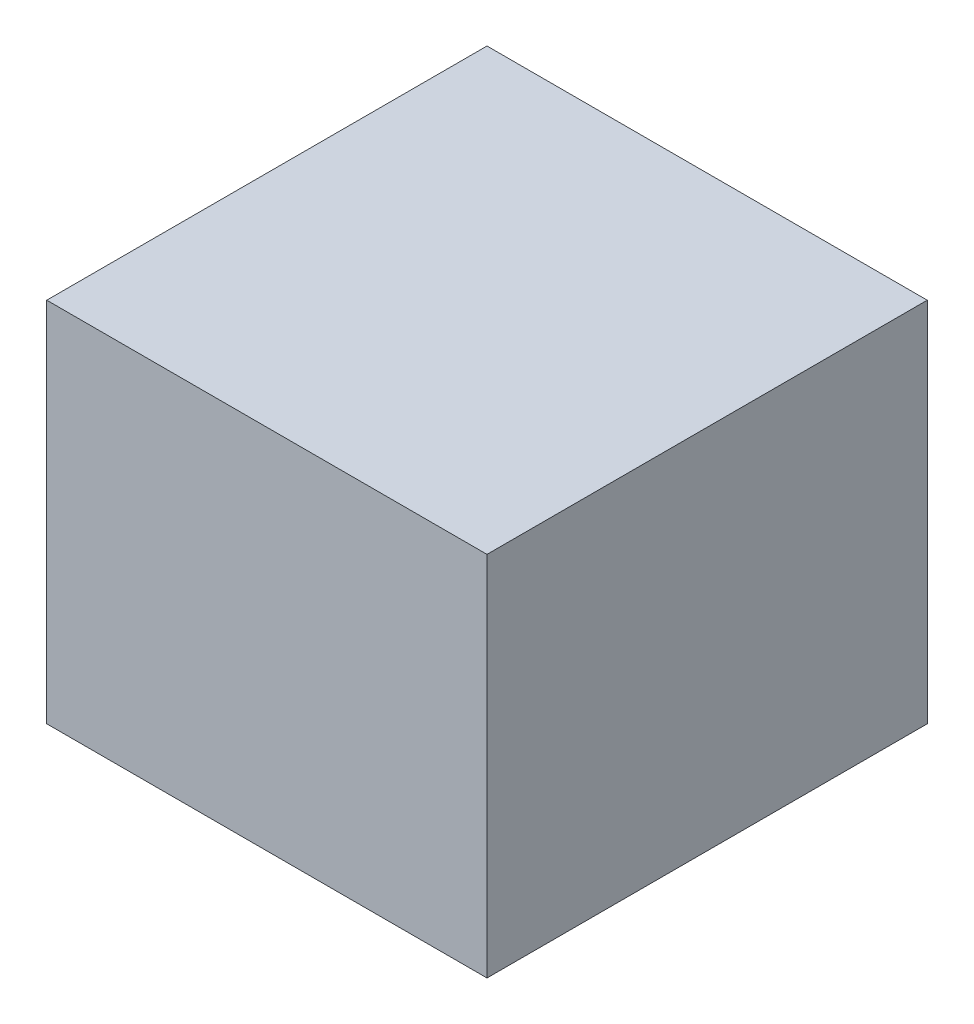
ISO-10303-21;
HEADER;
FILE_DESCRIPTION(('STEP AP214'),'2;1');
FILE_NAME('part.step','',(''),(''),'','','');
FILE_SCHEMA(('AUTOMOTIVE_DESIGN { 1 0 10303 214 1 1 1 1 }'));
ENDSEC;
DATA;
#1=APPLICATION_CONTEXT('core data for automotive mechanical design processes');
#2=APPLICATION_PROTOCOL_DEFINITION('international standard','automotive_design',2000,#1);
#3=PRODUCT_CONTEXT('',#1,'mechanical');
#4=PRODUCT('Part','Part','',(#3));
#5=PRODUCT_RELATED_PRODUCT_CATEGORY('part','',(#4));
#6=PRODUCT_DEFINITION_FORMATION('','',#4);
#7=PRODUCT_DEFINITION_CONTEXT('part definition',#1,'design');
#8=PRODUCT_DEFINITION('design','',#6,#7);
#9=PRODUCT_DEFINITION_SHAPE('','',#8);
#10=(LENGTH_UNIT() NAMED_UNIT(*) SI_UNIT(.MILLI.,.METRE.));
#11=(NAMED_UNIT(*) PLANE_ANGLE_UNIT() SI_UNIT($,.RADIAN.));
#12=(NAMED_UNIT(*) SI_UNIT($,.STERADIAN.) SOLID_ANGLE_UNIT());
#13=UNCERTAINTY_MEASURE_WITH_UNIT(LENGTH_MEASURE(1.E-05),#10,'distance_accuracy_value','');
#14=(GEOMETRIC_REPRESENTATION_CONTEXT(3) GLOBAL_UNCERTAINTY_ASSIGNED_CONTEXT((#13)) GLOBAL_UNIT_ASSIGNED_CONTEXT((#10,
#11,#12)) REPRESENTATION_CONTEXT('',''));
#15=CARTESIAN_POINT('',(0.,0.,0.));
#16=DIRECTION('',(0.,0.,1.));
#17=DIRECTION('',(1.,0.,0.));
#18=AXIS2_PLACEMENT_3D('',#15,#16,#17);
#19=CARTESIAN_POINT('',(30.,50.,30.));
#20=DIRECTION('',(-1.,0.,0.));
#21=DIRECTION('',(0.,0.,1.));
#22=AXIS2_PLACEMENT_3D('',#19,#20,#21);
#23=PLANE('',#22);
#24=DIRECTION('',(0.,0.,-1.));
#25=VECTOR('',#24,1.);
#26=CARTESIAN_POINT('',(30.,0.,30.));
#27=LINE('',#26,#25);
#28=CARTESIAN_POINT('',(30.,0.,30.));
#29=VERTEX_POINT('',#28);
#30=CARTESIAN_POINT('',(30.,0.,-30.));
#31=VERTEX_POINT('',#30);
#32=EDGE_CURVE('E70',#29,#31,#27,.T.);
#33=ORIENTED_EDGE('',*,*,#32,.T.);
#34=DIRECTION('',(0.,-1.,0.));
#35=VECTOR('',#34,1.);
#36=CARTESIAN_POINT('',(30.,50.,-30.));
#37=LINE('',#36,#35);
#38=CARTESIAN_POINT('',(30.,50.,-30.));
#39=VERTEX_POINT('',#38);
#40=EDGE_CURVE('E11',#39,#31,#37,.T.);
#41=ORIENTED_EDGE('',*,*,#40,.F.);
#42=DIRECTION('',(0.,0.,-1.));
#43=VECTOR('',#42,1.);
#44=CARTESIAN_POINT('',(30.,50.,30.));
#45=LINE('',#44,#43);
#46=CARTESIAN_POINT('',(30.,50.,30.));
#47=VERTEX_POINT('',#46);
#48=EDGE_CURVE('E88',#47,#39,#45,.T.);
#49=ORIENTED_EDGE('',*,*,#48,.F.);
#50=DIRECTION('',(0.,-1.,0.));
#51=VECTOR('',#50,1.);
#52=CARTESIAN_POINT('',(30.,50.,30.));
#53=LINE('',#52,#51);
#54=EDGE_CURVE('E82',#47,#29,#53,.T.);
#55=ORIENTED_EDGE('',*,*,#54,.T.);
#56=EDGE_LOOP('',(#33,#41,#49,#55));
#57=FACE_BOUND('',#56,.T.);
#58=ADVANCED_FACE('F26',(#57),#23,.F.);
#59=CARTESIAN_POINT('',(30.,50.,-30.));
#60=DIRECTION('',(0.,0.,1.));
#61=DIRECTION('',(1.,0.,0.));
#62=AXIS2_PLACEMENT_3D('',#59,#60,#61);
#63=PLANE('',#62);
#64=DIRECTION('',(-1.,0.,0.));
#65=VECTOR('',#64,1.);
#66=CARTESIAN_POINT('',(30.,0.,-30.));
#67=LINE('',#66,#65);
#68=CARTESIAN_POINT('',(-30.,0.,-30.));
#69=VERTEX_POINT('',#68);
#70=EDGE_CURVE('E66',#31,#69,#67,.T.);
#71=ORIENTED_EDGE('',*,*,#70,.T.);
#72=DIRECTION('',(0.,-1.,0.));
#73=VECTOR('',#72,1.);
#74=CARTESIAN_POINT('',(-30.,50.,-30.));
#75=LINE('',#74,#73);
#76=CARTESIAN_POINT('',(-30.,50.,-30.));
#77=VERTEX_POINT('',#76);
#78=EDGE_CURVE('E33',#77,#69,#75,.T.);
#79=ORIENTED_EDGE('',*,*,#78,.F.);
#80=DIRECTION('',(-1.,0.,0.));
#81=VECTOR('',#80,1.);
#82=CARTESIAN_POINT('',(30.,50.,-30.));
#83=LINE('',#82,#81);
#84=EDGE_CURVE('E78',#39,#77,#83,.T.);
#85=ORIENTED_EDGE('',*,*,#84,.F.);
#86=ORIENTED_EDGE('',*,*,#40,.T.);
#87=EDGE_LOOP('',(#71,#79,#85,#86));
#88=FACE_BOUND('',#87,.T.);
#89=ADVANCED_FACE('F77',(#88),#63,.F.);
#90=CARTESIAN_POINT('',(-30.,50.,30.));
#91=DIRECTION('',(1.,0.,0.));
#92=DIRECTION('',(0.,0.,-1.));
#93=AXIS2_PLACEMENT_3D('',#90,#91,#92);
#94=PLANE('',#93);
#95=DIRECTION('',(0.,0.,1.));
#96=VECTOR('',#95,1.);
#97=CARTESIAN_POINT('',(-30.,0.,30.));
#98=LINE('',#97,#96);
#99=CARTESIAN_POINT('',(-30.,0.,30.));
#100=VERTEX_POINT('',#99);
#101=EDGE_CURVE('E71',#69,#100,#98,.T.);
#102=ORIENTED_EDGE('',*,*,#101,.T.);
#103=DIRECTION('',(0.,-1.,0.));
#104=VECTOR('',#103,1.);
#105=CARTESIAN_POINT('',(-30.,50.,30.));
#106=LINE('',#105,#104);
#107=CARTESIAN_POINT('',(-30.,50.,30.));
#108=VERTEX_POINT('',#107);
#109=EDGE_CURVE('E94',#108,#100,#106,.T.);
#110=ORIENTED_EDGE('',*,*,#109,.F.);
#111=DIRECTION('',(0.,0.,1.));
#112=VECTOR('',#111,1.);
#113=CARTESIAN_POINT('',(-30.,50.,30.));
#114=LINE('',#113,#112);
#115=EDGE_CURVE('E45',#77,#108,#114,.T.);
#116=ORIENTED_EDGE('',*,*,#115,.F.);
#117=ORIENTED_EDGE('',*,*,#78,.T.);
#118=EDGE_LOOP('',(#102,#110,#116,#117));
#119=FACE_BOUND('',#118,.T.);
#120=ADVANCED_FACE('F97',(#119),#94,.F.);
#121=CARTESIAN_POINT('',(30.,50.,30.));
#122=DIRECTION('',(0.,0.,-1.));
#123=DIRECTION('',(-1.,0.,0.));
#124=AXIS2_PLACEMENT_3D('',#121,#122,#123);
#125=PLANE('',#124);
#126=DIRECTION('',(1.,0.,0.));
#127=VECTOR('',#126,1.);
#128=CARTESIAN_POINT('',(30.,0.,30.));
#129=LINE('',#128,#127);
#130=EDGE_CURVE('E86',#100,#29,#129,.T.);
#131=ORIENTED_EDGE('',*,*,#130,.T.);
#132=ORIENTED_EDGE('',*,*,#54,.F.);
#133=DIRECTION('',(1.,0.,0.));
#134=VECTOR('',#133,1.);
#135=CARTESIAN_POINT('',(30.,50.,30.));
#136=LINE('',#135,#134);
#137=EDGE_CURVE('E40',#108,#47,#136,.T.);
#138=ORIENTED_EDGE('',*,*,#137,.F.);
#139=ORIENTED_EDGE('',*,*,#109,.T.);
#140=EDGE_LOOP('',(#131,#132,#138,#139));
#141=FACE_BOUND('',#140,.T.);
#142=ADVANCED_FACE('F99',(#141),#125,.F.);
#143=CARTESIAN_POINT('',(30.,50.,-30.));
#144=DIRECTION('',(0.,1.,0.));
#145=DIRECTION('',(0.,0.,1.));
#146=AXIS2_PLACEMENT_3D('',#143,#144,#145);
#147=PLANE('',#146);
#148=ORIENTED_EDGE('',*,*,#48,.T.);
#149=ORIENTED_EDGE('',*,*,#84,.T.);
#150=ORIENTED_EDGE('',*,*,#115,.T.);
#151=ORIENTED_EDGE('',*,*,#137,.T.);
#152=EDGE_LOOP('',(#148,#149,#150,#151));
#153=FACE_BOUND('',#152,.T.);
#154=ADVANCED_FACE('F100',(#153),#147,.T.);
#155=CARTESIAN_POINT('',(30.,0.,-30.));
#156=DIRECTION('',(0.,1.,0.));
#157=DIRECTION('',(0.,0.,1.));
#158=AXIS2_PLACEMENT_3D('',#155,#156,#157);
#159=PLANE('',#158);
#160=ORIENTED_EDGE('',*,*,#32,.F.);
#161=ORIENTED_EDGE('',*,*,#130,.F.);
#162=ORIENTED_EDGE('',*,*,#101,.F.);
#163=ORIENTED_EDGE('',*,*,#70,.F.);
#164=EDGE_LOOP('',(#160,#161,#162,#163));
#165=FACE_BOUND('',#164,.T.);
#166=ADVANCED_FACE('F67',(#165),#159,.F.);
#167=CLOSED_SHELL('',(#58,#89,#120,#142,#154,#166));
#168=MANIFOLD_SOLID_BREP('B2',#167);
#169=ADVANCED_BREP_SHAPE_REPRESENTATION('',(#18,#168),#14);
#170=SHAPE_DEFINITION_REPRESENTATION(#9,#169);
ENDSEC;
END-ISO-10303-21;
